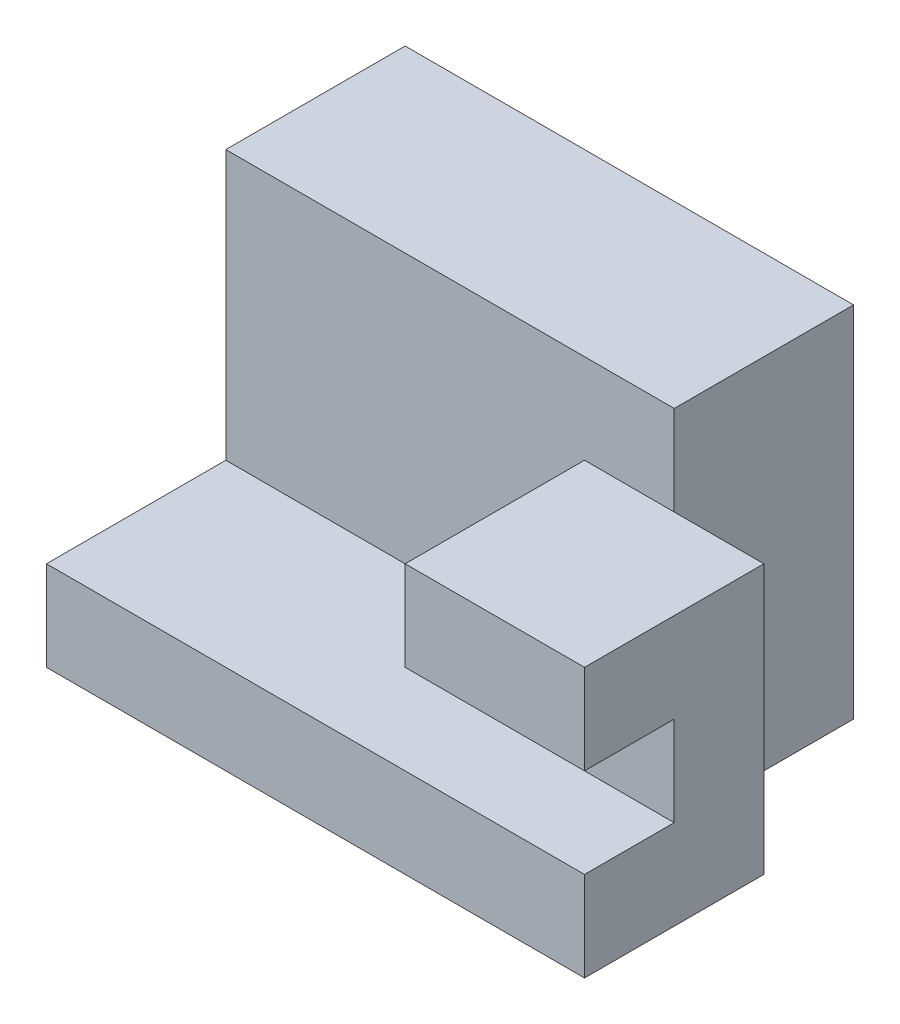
ISO-10303-21;
HEADER;
FILE_DESCRIPTION(('STEP AP214'),'2;1');
FILE_NAME('part.step','',(''),(''),'','','');
FILE_SCHEMA(('AUTOMOTIVE_DESIGN { 1 0 10303 214 1 1 1 1 }'));
ENDSEC;
DATA;
#1=APPLICATION_CONTEXT('core data for automotive mechanical design processes');
#2=APPLICATION_PROTOCOL_DEFINITION('international standard','automotive_design',2000,#1);
#3=PRODUCT_CONTEXT('',#1,'mechanical');
#4=PRODUCT('Part','Part','',(#3));
#5=PRODUCT_RELATED_PRODUCT_CATEGORY('part','',(#4));
#6=PRODUCT_DEFINITION_FORMATION('','',#4);
#7=PRODUCT_DEFINITION_CONTEXT('part definition',#1,'design');
#8=PRODUCT_DEFINITION('design','',#6,#7);
#9=PRODUCT_DEFINITION_SHAPE('','',#8);
#10=(LENGTH_UNIT() NAMED_UNIT(*) SI_UNIT(.MILLI.,.METRE.));
#11=(NAMED_UNIT(*) PLANE_ANGLE_UNIT() SI_UNIT($,.RADIAN.));
#12=(NAMED_UNIT(*) SI_UNIT($,.STERADIAN.) SOLID_ANGLE_UNIT());
#13=UNCERTAINTY_MEASURE_WITH_UNIT(LENGTH_MEASURE(1.E-05),#10,'distance_accuracy_value','');
#14=(GEOMETRIC_REPRESENTATION_CONTEXT(3) GLOBAL_UNCERTAINTY_ASSIGNED_CONTEXT((#13)) GLOBAL_UNIT_ASSIGNED_CONTEXT((#10,
#11,#12)) REPRESENTATION_CONTEXT('',''));
#15=CARTESIAN_POINT('',(0.,0.,0.));
#16=DIRECTION('',(0.,0.,1.));
#17=DIRECTION('',(1.,0.,0.));
#18=AXIS2_PLACEMENT_3D('',#15,#16,#17);
#19=CARTESIAN_POINT('',(-50.,20.,20.));
#20=DIRECTION('',(0.,0.,1.));
#21=DIRECTION('',(1.,0.,0.));
#22=AXIS2_PLACEMENT_3D('',#19,#20,#21);
#23=PLANE('',#22);
#24=DIRECTION('',(0.,-1.,0.));
#25=VECTOR('',#24,1.);
#26=CARTESIAN_POINT('',(-10.,20.,20.));
#27=LINE('',#26,#25);
#28=CARTESIAN_POINT('',(-10.,30.,20.));
#29=VERTEX_POINT('',#28);
#30=CARTESIAN_POINT('',(-10.,10.,20.));
#31=VERTEX_POINT('',#30);
#32=EDGE_CURVE('E135',#29,#31,#27,.T.);
#33=ORIENTED_EDGE('',*,*,#32,.F.);
#34=DIRECTION('',(-1.,0.,0.));
#35=VECTOR('',#34,1.);
#36=CARTESIAN_POINT('',(10.,30.,20.));
#37=LINE('',#36,#35);
#38=CARTESIAN_POINT('',(0.,30.,20.));
#39=VERTEX_POINT('',#38);
#40=EDGE_CURVE('E233',#39,#29,#37,.T.);
#41=ORIENTED_EDGE('',*,*,#40,.F.);
#42=DIRECTION('',(0.,-1.,0.));
#43=VECTOR('',#42,1.);
#44=CARTESIAN_POINT('',(0.,20.,20.));
#45=LINE('',#44,#43);
#46=CARTESIAN_POINT('',(0.,40.,20.));
#47=VERTEX_POINT('',#46);
#48=EDGE_CURVE('E114',#47,#39,#45,.T.);
#49=ORIENTED_EDGE('',*,*,#48,.F.);
#50=DIRECTION('',(1.,0.,0.));
#51=VECTOR('',#50,1.);
#52=CARTESIAN_POINT('',(-50.,40.,20.));
#53=LINE('',#52,#51);
#54=CARTESIAN_POINT('',(-50.,40.,20.));
#55=VERTEX_POINT('',#54);
#56=EDGE_CURVE('E40',#55,#47,#53,.T.);
#57=ORIENTED_EDGE('',*,*,#56,.F.);
#58=DIRECTION('',(0.,-1.,0.));
#59=VECTOR('',#58,1.);
#60=CARTESIAN_POINT('',(-50.,20.,20.));
#61=LINE('',#60,#59);
#62=CARTESIAN_POINT('',(-50.,10.,20.));
#63=VERTEX_POINT('',#62);
#64=EDGE_CURVE('E124',#55,#63,#61,.T.);
#65=ORIENTED_EDGE('',*,*,#64,.T.);
#66=DIRECTION('',(1.,0.,0.));
#67=VECTOR('',#66,1.);
#68=CARTESIAN_POINT('',(-50.,10.,20.));
#69=LINE('',#68,#67);
#70=EDGE_CURVE('E74',#63,#31,#69,.T.);
#71=ORIENTED_EDGE('',*,*,#70,.T.);
#72=EDGE_LOOP('',(#33,#41,#49,#57,#65,#71));
#73=FACE_BOUND('',#72,.T.);
#74=ADVANCED_FACE('F32',(#73),#23,.T.);
#75=CARTESIAN_POINT('',(-50.,10.,-24.1414213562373));
#76=DIRECTION('',(0.,1.,0.));
#77=DIRECTION('',(0.,0.,1.));
#78=AXIS2_PLACEMENT_3D('',#75,#76,#77);
#79=PLANE('',#78);
#80=DIRECTION('',(1.,0.,0.));
#81=VECTOR('',#80,1.);
#82=CARTESIAN_POINT('',(-50.,10.,40.));
#83=LINE('',#82,#81);
#84=CARTESIAN_POINT('',(-50.,10.,40.));
#85=VERTEX_POINT('',#84);
#86=CARTESIAN_POINT('',(10.,10.,40.));
#87=VERTEX_POINT('',#86);
#88=EDGE_CURVE('E128',#85,#87,#83,.T.);
#89=ORIENTED_EDGE('',*,*,#88,.T.);
#90=DIRECTION('',(0.,0.,1.));
#91=VECTOR('',#90,1.);
#92=CARTESIAN_POINT('',(10.,10.,-24.1414213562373));
#93=LINE('',#92,#91);
#94=CARTESIAN_POINT('',(10.,10.,30.));
#95=VERTEX_POINT('',#94);
#96=EDGE_CURVE('E193',#95,#87,#93,.T.);
#97=ORIENTED_EDGE('',*,*,#96,.F.);
#98=DIRECTION('',(-1.,0.,0.));
#99=VECTOR('',#98,1.);
#100=CARTESIAN_POINT('',(10.,10.,30.));
#101=LINE('',#100,#99);
#102=CARTESIAN_POINT('',(-10.,10.,30.));
#103=VERTEX_POINT('',#102);
#104=EDGE_CURVE('E182',#95,#103,#101,.T.);
#105=ORIENTED_EDGE('',*,*,#104,.T.);
#106=DIRECTION('',(0.,0.,-1.));
#107=VECTOR('',#106,1.);
#108=CARTESIAN_POINT('',(-10.,10.,-24.1414213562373));
#109=LINE('',#108,#107);
#110=EDGE_CURVE('E11',#103,#31,#109,.T.);
#111=ORIENTED_EDGE('',*,*,#110,.T.);
#112=ORIENTED_EDGE('',*,*,#70,.F.);
#113=DIRECTION('',(0.,0.,1.));
#114=VECTOR('',#113,1.);
#115=CARTESIAN_POINT('',(-50.,10.,-24.1414213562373));
#116=LINE('',#115,#114);
#117=EDGE_CURVE('E109',#63,#85,#116,.T.);
#118=ORIENTED_EDGE('',*,*,#117,.T.);
#119=EDGE_LOOP('',(#89,#97,#105,#111,#112,#118));
#120=FACE_BOUND('',#119,.T.);
#121=ADVANCED_FACE('F194',(#120),#79,.T.);
#122=CARTESIAN_POINT('',(-50.,40.,-24.1414213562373));
#123=DIRECTION('',(0.,1.,0.));
#124=DIRECTION('',(0.,0.,1.));
#125=AXIS2_PLACEMENT_3D('',#122,#123,#124);
#126=PLANE('',#125);
#127=DIRECTION('',(0.,0.,1.));
#128=VECTOR('',#127,1.);
#129=CARTESIAN_POINT('',(0.,40.,-24.1414213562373));
#130=LINE('',#129,#128);
#131=CARTESIAN_POINT('',(0.,40.,0.));
#132=VERTEX_POINT('',#131);
#133=EDGE_CURVE('E121',#132,#47,#130,.T.);
#134=ORIENTED_EDGE('',*,*,#133,.F.);
#135=DIRECTION('',(1.,0.,0.));
#136=VECTOR('',#135,1.);
#137=CARTESIAN_POINT('',(-50.,40.,0.));
#138=LINE('',#137,#136);
#139=CARTESIAN_POINT('',(-50.,40.,0.));
#140=VERTEX_POINT('',#139);
#141=EDGE_CURVE('E62',#140,#132,#138,.T.);
#142=ORIENTED_EDGE('',*,*,#141,.F.);
#143=DIRECTION('',(0.,0.,1.));
#144=VECTOR('',#143,1.);
#145=CARTESIAN_POINT('',(-50.,40.,-24.1414213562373));
#146=LINE('',#145,#144);
#147=EDGE_CURVE('E102',#140,#55,#146,.T.);
#148=ORIENTED_EDGE('',*,*,#147,.T.);
#149=ORIENTED_EDGE('',*,*,#56,.T.);
#150=EDGE_LOOP('',(#134,#142,#148,#149));
#151=FACE_BOUND('',#150,.T.);
#152=ADVANCED_FACE('F269',(#151),#126,.T.);
#153=CARTESIAN_POINT('',(-50.,20.,0.));
#154=DIRECTION('',(0.,0.,-1.));
#155=DIRECTION('',(-1.,0.,0.));
#156=AXIS2_PLACEMENT_3D('',#153,#154,#155);
#157=PLANE('',#156);
#158=DIRECTION('',(0.,1.,0.));
#159=VECTOR('',#158,1.);
#160=CARTESIAN_POINT('',(0.,20.,0.));
#161=LINE('',#160,#159);
#162=CARTESIAN_POINT('',(0.,0.,0.));
#163=VERTEX_POINT('',#162);
#164=EDGE_CURVE('E90',#163,#132,#161,.T.);
#165=ORIENTED_EDGE('',*,*,#164,.F.);
#166=DIRECTION('',(1.,0.,0.));
#167=VECTOR('',#166,1.);
#168=CARTESIAN_POINT('',(-50.,0.,0.));
#169=LINE('',#168,#167);
#170=CARTESIAN_POINT('',(-50.,0.,0.));
#171=VERTEX_POINT('',#170);
#172=EDGE_CURVE('E85',#171,#163,#169,.T.);
#173=ORIENTED_EDGE('',*,*,#172,.F.);
#174=DIRECTION('',(0.,1.,0.));
#175=VECTOR('',#174,1.);
#176=CARTESIAN_POINT('',(-50.,20.,0.));
#177=LINE('',#176,#175);
#178=EDGE_CURVE('E88',#171,#140,#177,.T.);
#179=ORIENTED_EDGE('',*,*,#178,.T.);
#180=ORIENTED_EDGE('',*,*,#141,.T.);
#181=EDGE_LOOP('',(#165,#173,#179,#180));
#182=FACE_BOUND('',#181,.T.);
#183=ADVANCED_FACE('F87',(#182),#157,.T.);
#184=CARTESIAN_POINT('',(-50.,0.,-24.1414213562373));
#185=DIRECTION('',(0.,-1.,0.));
#186=DIRECTION('',(0.,0.,-1.));
#187=AXIS2_PLACEMENT_3D('',#184,#185,#186);
#188=PLANE('',#187);
#189=DIRECTION('',(0.,0.,-1.));
#190=VECTOR('',#189,1.);
#191=CARTESIAN_POINT('',(0.,0.,-24.1414213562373));
#192=LINE('',#191,#190);
#193=CARTESIAN_POINT('',(0.,0.,20.));
#194=VERTEX_POINT('',#193);
#195=EDGE_CURVE('E117',#194,#163,#192,.T.);
#196=ORIENTED_EDGE('',*,*,#195,.F.);
#197=DIRECTION('',(-1.,0.,0.));
#198=VECTOR('',#197,1.);
#199=CARTESIAN_POINT('',(10.,0.,20.));
#200=LINE('',#199,#198);
#201=CARTESIAN_POINT('',(10.,0.,20.));
#202=VERTEX_POINT('',#201);
#203=EDGE_CURVE('E190',#202,#194,#200,.T.);
#204=ORIENTED_EDGE('',*,*,#203,.F.);
#205=DIRECTION('',(0.,0.,-1.));
#206=VECTOR('',#205,1.);
#207=CARTESIAN_POINT('',(10.,0.,-24.1414213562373));
#208=LINE('',#207,#206);
#209=CARTESIAN_POINT('',(10.,0.,40.));
#210=VERTEX_POINT('',#209);
#211=EDGE_CURVE('E210',#210,#202,#208,.T.);
#212=ORIENTED_EDGE('',*,*,#211,.F.);
#213=DIRECTION('',(1.,0.,0.));
#214=VECTOR('',#213,1.);
#215=CARTESIAN_POINT('',(-50.,0.,40.));
#216=LINE('',#215,#214);
#217=CARTESIAN_POINT('',(-50.,0.,40.));
#218=VERTEX_POINT('',#217);
#219=EDGE_CURVE('E94',#218,#210,#216,.T.);
#220=ORIENTED_EDGE('',*,*,#219,.F.);
#221=DIRECTION('',(0.,0.,-1.));
#222=VECTOR('',#221,1.);
#223=CARTESIAN_POINT('',(-50.,0.,-24.1414213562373));
#224=LINE('',#223,#222);
#225=EDGE_CURVE('E100',#218,#171,#224,.T.);
#226=ORIENTED_EDGE('',*,*,#225,.T.);
#227=ORIENTED_EDGE('',*,*,#172,.T.);
#228=EDGE_LOOP('',(#196,#204,#212,#220,#226,#227));
#229=FACE_BOUND('',#228,.T.);
#230=ADVANCED_FACE('F104',(#229),#188,.T.);
#231=CARTESIAN_POINT('',(-50.,20.,40.));
#232=DIRECTION('',(0.,0.,1.));
#233=DIRECTION('',(1.,0.,0.));
#234=AXIS2_PLACEMENT_3D('',#231,#232,#233);
#235=PLANE('',#234);
#236=DIRECTION('',(0.,-1.,0.));
#237=VECTOR('',#236,1.);
#238=CARTESIAN_POINT('',(10.,20.,40.));
#239=LINE('',#238,#237);
#240=EDGE_CURVE('E198',#87,#210,#239,.T.);
#241=ORIENTED_EDGE('',*,*,#240,.F.);
#242=ORIENTED_EDGE('',*,*,#88,.F.);
#243=DIRECTION('',(0.,-1.,0.));
#244=VECTOR('',#243,1.);
#245=CARTESIAN_POINT('',(-50.,20.,40.));
#246=LINE('',#245,#244);
#247=EDGE_CURVE('E107',#85,#218,#246,.T.);
#248=ORIENTED_EDGE('',*,*,#247,.T.);
#249=ORIENTED_EDGE('',*,*,#219,.T.);
#250=EDGE_LOOP('',(#241,#242,#248,#249));
#251=FACE_BOUND('',#250,.T.);
#252=ADVANCED_FACE('F240',(#251),#235,.T.);
#253=CARTESIAN_POINT('',(-50.,20.,-24.1414213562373));
#254=DIRECTION('',(1.,0.,0.));
#255=DIRECTION('',(0.,0.,-1.));
#256=AXIS2_PLACEMENT_3D('',#253,#254,#255);
#257=PLANE('',#256);
#258=ORIENTED_EDGE('',*,*,#64,.F.);
#259=ORIENTED_EDGE('',*,*,#147,.F.);
#260=ORIENTED_EDGE('',*,*,#178,.F.);
#261=ORIENTED_EDGE('',*,*,#225,.F.);
#262=ORIENTED_EDGE('',*,*,#247,.F.);
#263=ORIENTED_EDGE('',*,*,#117,.F.);
#264=EDGE_LOOP('',(#258,#259,#260,#261,#262,#263));
#265=FACE_BOUND('',#264,.T.);
#266=ADVANCED_FACE('F98',(#265),#257,.F.);
#267=CARTESIAN_POINT('',(0.,20.,-24.1414213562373));
#268=DIRECTION('',(1.,0.,0.));
#269=DIRECTION('',(0.,0.,-1.));
#270=AXIS2_PLACEMENT_3D('',#267,#268,#269);
#271=PLANE('',#270);
#272=EDGE_CURVE('E118',#39,#194,#45,.T.);
#273=ORIENTED_EDGE('',*,*,#272,.T.);
#274=ORIENTED_EDGE('',*,*,#195,.T.);
#275=ORIENTED_EDGE('',*,*,#164,.T.);
#276=ORIENTED_EDGE('',*,*,#133,.T.);
#277=ORIENTED_EDGE('',*,*,#48,.T.);
#278=EDGE_LOOP('',(#273,#274,#275,#276,#277));
#279=FACE_BOUND('',#278,.T.);
#280=ADVANCED_FACE('F281',(#279),#271,.T.);
#281=CARTESIAN_POINT('',(10.,20.,30.));
#282=DIRECTION('',(0.,0.,-1.));
#283=DIRECTION('',(0.,1.,0.));
#284=AXIS2_PLACEMENT_3D('',#281,#282,#283);
#285=PLANE('',#284);
#286=DIRECTION('',(0.,-1.,0.));
#287=VECTOR('',#286,1.);
#288=CARTESIAN_POINT('',(-10.,20.,30.));
#289=LINE('',#288,#287);
#290=CARTESIAN_POINT('',(-10.,20.,30.));
#291=VERTEX_POINT('',#290);
#292=EDGE_CURVE('E189',#291,#103,#289,.T.);
#293=ORIENTED_EDGE('',*,*,#292,.T.);
#294=ORIENTED_EDGE('',*,*,#104,.F.);
#295=DIRECTION('',(0.,-1.,0.));
#296=VECTOR('',#295,1.);
#297=CARTESIAN_POINT('',(10.,20.,30.));
#298=LINE('',#297,#296);
#299=CARTESIAN_POINT('',(10.,20.,30.));
#300=VERTEX_POINT('',#299);
#301=EDGE_CURVE('E187',#300,#95,#298,.T.);
#302=ORIENTED_EDGE('',*,*,#301,.F.);
#303=DIRECTION('',(-1.,0.,0.));
#304=VECTOR('',#303,1.);
#305=CARTESIAN_POINT('',(10.,20.,30.));
#306=LINE('',#305,#304);
#307=EDGE_CURVE('E220',#300,#291,#306,.T.);
#308=ORIENTED_EDGE('',*,*,#307,.T.);
#309=EDGE_LOOP('',(#293,#294,#302,#308));
#310=FACE_BOUND('',#309,.T.);
#311=ADVANCED_FACE('F184',(#310),#285,.F.);
#312=CARTESIAN_POINT('',(10.,20.,20.));
#313=DIRECTION('',(0.,0.,-1.));
#314=DIRECTION('',(-1.,0.,0.));
#315=AXIS2_PLACEMENT_3D('',#312,#313,#314);
#316=PLANE('',#315);
#317=ORIENTED_EDGE('',*,*,#203,.T.);
#318=ORIENTED_EDGE('',*,*,#272,.F.);
#319=CARTESIAN_POINT('',(10.,30.,20.));
#320=VERTEX_POINT('',#319);
#321=EDGE_CURVE('E234',#320,#39,#37,.T.);
#322=ORIENTED_EDGE('',*,*,#321,.F.);
#323=DIRECTION('',(0.,-1.,0.));
#324=VECTOR('',#323,1.);
#325=CARTESIAN_POINT('',(10.,20.,20.));
#326=LINE('',#325,#324);
#327=EDGE_CURVE('E212',#320,#202,#326,.T.);
#328=ORIENTED_EDGE('',*,*,#327,.T.);
#329=EDGE_LOOP('',(#317,#318,#322,#328));
#330=FACE_BOUND('',#329,.T.);
#331=ADVANCED_FACE('F244',(#330),#316,.T.);
#332=CARTESIAN_POINT('',(10.,30.,-24.1414213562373));
#333=DIRECTION('',(0.,-1.,0.));
#334=DIRECTION('',(0.,0.,-1.));
#335=AXIS2_PLACEMENT_3D('',#332,#333,#334);
#336=PLANE('',#335);
#337=DIRECTION('',(0.,0.,1.));
#338=VECTOR('',#337,1.);
#339=CARTESIAN_POINT('',(-10.,30.,-24.1414213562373));
#340=LINE('',#339,#338);
#341=CARTESIAN_POINT('',(-10.,30.,40.));
#342=VERTEX_POINT('',#341);
#343=EDGE_CURVE('E223',#29,#342,#340,.T.);
#344=ORIENTED_EDGE('',*,*,#343,.T.);
#345=DIRECTION('',(-1.,0.,0.));
#346=VECTOR('',#345,1.);
#347=CARTESIAN_POINT('',(10.,30.,40.));
#348=LINE('',#347,#346);
#349=CARTESIAN_POINT('',(10.,30.,40.));
#350=VERTEX_POINT('',#349);
#351=EDGE_CURVE('E230',#350,#342,#348,.T.);
#352=ORIENTED_EDGE('',*,*,#351,.F.);
#353=DIRECTION('',(0.,0.,1.));
#354=VECTOR('',#353,1.);
#355=CARTESIAN_POINT('',(10.,30.,-24.1414213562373));
#356=LINE('',#355,#354);
#357=EDGE_CURVE('E215',#320,#350,#356,.T.);
#358=ORIENTED_EDGE('',*,*,#357,.F.);
#359=ORIENTED_EDGE('',*,*,#321,.T.);
#360=ORIENTED_EDGE('',*,*,#40,.T.);
#361=EDGE_LOOP('',(#344,#352,#358,#359,#360));
#362=FACE_BOUND('',#361,.T.);
#363=ADVANCED_FACE('F250',(#362),#336,.F.);
#364=CARTESIAN_POINT('',(10.,20.,40.));
#365=DIRECTION('',(0.,0.,-1.));
#366=DIRECTION('',(-1.,0.,0.));
#367=AXIS2_PLACEMENT_3D('',#364,#365,#366);
#368=PLANE('',#367);
#369=DIRECTION('',(0.,-1.,0.));
#370=VECTOR('',#369,1.);
#371=CARTESIAN_POINT('',(-10.,20.,40.));
#372=LINE('',#371,#370);
#373=CARTESIAN_POINT('',(-10.,20.,40.));
#374=VERTEX_POINT('',#373);
#375=EDGE_CURVE('E206',#342,#374,#372,.T.);
#376=ORIENTED_EDGE('',*,*,#375,.T.);
#377=DIRECTION('',(-1.,0.,0.));
#378=VECTOR('',#377,1.);
#379=CARTESIAN_POINT('',(10.,20.,40.));
#380=LINE('',#379,#378);
#381=CARTESIAN_POINT('',(10.,20.,40.));
#382=VERTEX_POINT('',#381);
#383=EDGE_CURVE('E227',#382,#374,#380,.T.);
#384=ORIENTED_EDGE('',*,*,#383,.F.);
#385=DIRECTION('',(0.,-1.,0.));
#386=VECTOR('',#385,1.);
#387=CARTESIAN_POINT('',(10.,20.,40.));
#388=LINE('',#387,#386);
#389=EDGE_CURVE('E217',#350,#382,#388,.T.);
#390=ORIENTED_EDGE('',*,*,#389,.F.);
#391=ORIENTED_EDGE('',*,*,#351,.T.);
#392=EDGE_LOOP('',(#376,#384,#390,#391));
#393=FACE_BOUND('',#392,.T.);
#394=ADVANCED_FACE('F253',(#393),#368,.F.);
#395=CARTESIAN_POINT('',(10.,20.,-24.1414213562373));
#396=DIRECTION('',(0.,1.,0.));
#397=DIRECTION('',(0.,0.,1.));
#398=AXIS2_PLACEMENT_3D('',#395,#396,#397);
#399=PLANE('',#398);
#400=DIRECTION('',(0.,0.,-1.));
#401=VECTOR('',#400,1.);
#402=CARTESIAN_POINT('',(-10.,20.,-24.1414213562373));
#403=LINE('',#402,#401);
#404=EDGE_CURVE('E204',#374,#291,#403,.T.);
#405=ORIENTED_EDGE('',*,*,#404,.T.);
#406=ORIENTED_EDGE('',*,*,#307,.F.);
#407=DIRECTION('',(0.,0.,-1.));
#408=VECTOR('',#407,1.);
#409=CARTESIAN_POINT('',(10.,20.,-24.1414213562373));
#410=LINE('',#409,#408);
#411=EDGE_CURVE('E202',#382,#300,#410,.T.);
#412=ORIENTED_EDGE('',*,*,#411,.F.);
#413=ORIENTED_EDGE('',*,*,#383,.T.);
#414=EDGE_LOOP('',(#405,#406,#412,#413));
#415=FACE_BOUND('',#414,.T.);
#416=ADVANCED_FACE('F256',(#415),#399,.F.);
#417=CARTESIAN_POINT('',(10.,20.,-24.1414213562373));
#418=DIRECTION('',(1.,0.,0.));
#419=DIRECTION('',(0.,0.,-1.));
#420=AXIS2_PLACEMENT_3D('',#417,#418,#419);
#421=PLANE('',#420);
#422=ORIENTED_EDGE('',*,*,#301,.T.);
#423=ORIENTED_EDGE('',*,*,#96,.T.);
#424=ORIENTED_EDGE('',*,*,#240,.T.);
#425=ORIENTED_EDGE('',*,*,#211,.T.);
#426=ORIENTED_EDGE('',*,*,#327,.F.);
#427=ORIENTED_EDGE('',*,*,#357,.T.);
#428=ORIENTED_EDGE('',*,*,#389,.T.);
#429=ORIENTED_EDGE('',*,*,#411,.T.);
#430=EDGE_LOOP('',(#422,#423,#424,#425,#426,#427,#428,#429));
#431=FACE_BOUND('',#430,.T.);
#432=ADVANCED_FACE('F200',(#431),#421,.T.);
#433=CARTESIAN_POINT('',(-10.,20.,-24.1414213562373));
#434=DIRECTION('',(1.,0.,0.));
#435=DIRECTION('',(0.,0.,-1.));
#436=AXIS2_PLACEMENT_3D('',#433,#434,#435);
#437=PLANE('',#436);
#438=ORIENTED_EDGE('',*,*,#110,.F.);
#439=ORIENTED_EDGE('',*,*,#292,.F.);
#440=ORIENTED_EDGE('',*,*,#404,.F.);
#441=ORIENTED_EDGE('',*,*,#375,.F.);
#442=ORIENTED_EDGE('',*,*,#343,.F.);
#443=ORIENTED_EDGE('',*,*,#32,.T.);
#444=EDGE_LOOP('',(#438,#439,#440,#441,#442,#443));
#445=FACE_BOUND('',#444,.T.);
#446=ADVANCED_FACE('F257',(#445),#437,.F.);
#447=CLOSED_SHELL('',(#74,#121,#152,#183,#230,#252,#266,#280,#311,#331,#363,#394,#416,#432,#446));
#448=MANIFOLD_SOLID_BREP('B2',#447);
#449=ADVANCED_BREP_SHAPE_REPRESENTATION('',(#18,#448),#14);
#450=SHAPE_DEFINITION_REPRESENTATION(#9,#449);
ENDSEC;
END-ISO-10303-21;
